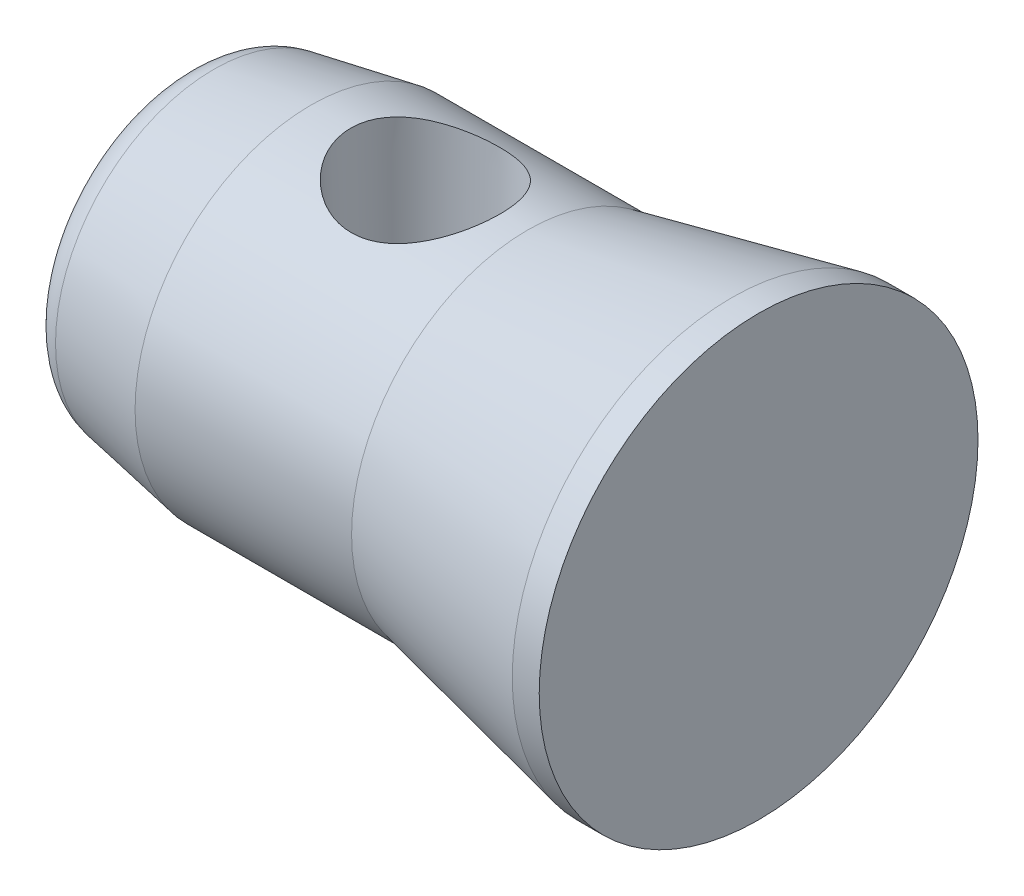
from build123d import *


with BuildPart() as part:
    # Esquisse1 → Base-R_volution (revolve)
    with BuildSketch(Plane.XY, mode=Mode.PRIVATE) as base_r_volution_sk:
        with BuildLine():
            Line((-33.874, 13.903), (-16.762, 13.903))
            Line((-16.762, 13.903), (-0.630670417, 17.338))
            Line((-0.630670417, 17.338), (1.5, 17.338))
            Line((1.5, 17.338), (1.5, 0))
            Line((1.5, 0), (-44.015, 0))
            Line((-44.015, 0), (-44.015, 9.560552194))
            ThreePointArc((-44.015, 9.560552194), (-43.317636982, 11.483535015), (-41.549758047, 12.512506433))
            Line((-41.549758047, 12.512506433), (-33.874, 13.903))
        make_face()
    revolve(base_r_volution_sk.sketch.rotate(Axis((-110, 0, 0), (1, 0, 0)), 90), axis=Axis((-110, 0, 0), (1, 0, 0)))

    # Esquisse2 → Enl_vement de mati_re-R_volution1 (revolve, cut)
    with BuildSketch(Plane.XY, mode=Mode.PRIVATE) as enl_vement_de_mati_re_r_volution1_sk:
        Polygon((-29.754607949, -19.5), (-30.903940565, 20), (-24.835, 20), (-24.835, -19.5), align=None)
    revolve(enl_vement_de_mati_re_r_volution1_sk.sketch.rotate(Axis((-24.835, 22.749452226, 0), (0, -1, 0)), 47.633792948), axis=Axis((-24.835, 22.749452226, 0), (0, -1, 0)), mode=Mode.SUBTRACT)


solid = part.part
